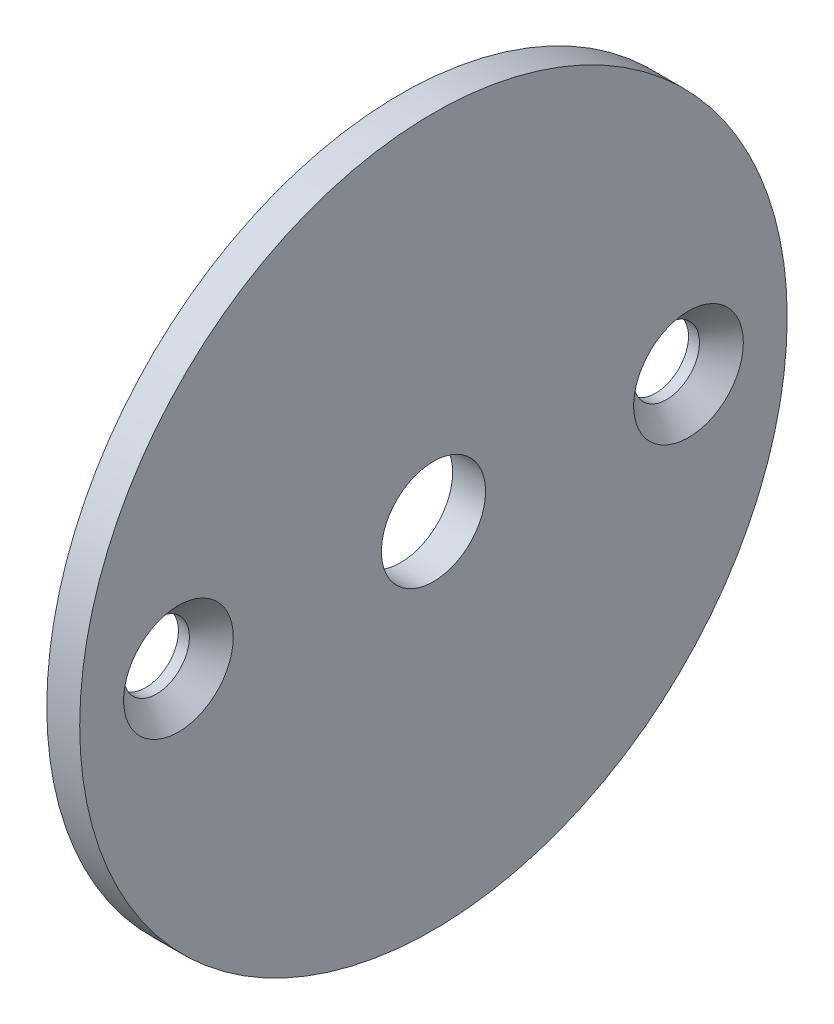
ISO-10303-21;
HEADER;
FILE_DESCRIPTION(('STEP AP214'),'2;1');
FILE_NAME('part.step','',(''),(''),'','','');
FILE_SCHEMA(('AUTOMOTIVE_DESIGN { 1 0 10303 214 1 1 1 1 }'));
ENDSEC;
DATA;
#1=APPLICATION_CONTEXT('core data for automotive mechanical design processes');
#2=APPLICATION_PROTOCOL_DEFINITION('international standard','automotive_design',2000,#1);
#3=PRODUCT_CONTEXT('',#1,'mechanical');
#4=PRODUCT('Part','Part','',(#3));
#5=PRODUCT_RELATED_PRODUCT_CATEGORY('part','',(#4));
#6=PRODUCT_DEFINITION_FORMATION('','',#4);
#7=PRODUCT_DEFINITION_CONTEXT('part definition',#1,'design');
#8=PRODUCT_DEFINITION('design','',#6,#7);
#9=PRODUCT_DEFINITION_SHAPE('','',#8);
#10=(LENGTH_UNIT() NAMED_UNIT(*) SI_UNIT(.MILLI.,.METRE.));
#11=(NAMED_UNIT(*) PLANE_ANGLE_UNIT() SI_UNIT($,.RADIAN.));
#12=(NAMED_UNIT(*) SI_UNIT($,.STERADIAN.) SOLID_ANGLE_UNIT());
#13=UNCERTAINTY_MEASURE_WITH_UNIT(LENGTH_MEASURE(1.E-05),#10,'distance_accuracy_value','');
#14=(GEOMETRIC_REPRESENTATION_CONTEXT(3) GLOBAL_UNCERTAINTY_ASSIGNED_CONTEXT((#13)) GLOBAL_UNIT_ASSIGNED_CONTEXT((#10,
#11,#12)) REPRESENTATION_CONTEXT('',''));
#15=CARTESIAN_POINT('',(0.,0.,0.));
#16=DIRECTION('',(0.,0.,1.));
#17=DIRECTION('',(1.,0.,0.));
#18=AXIS2_PLACEMENT_3D('',#15,#16,#17);
#19=CARTESIAN_POINT('',(-3.,0.,0.));
#20=DIRECTION('',(1.,0.,0.));
#21=DIRECTION('',(0.,0.,-1.));
#22=AXIS2_PLACEMENT_3D('',#19,#20,#21);
#23=CYLINDRICAL_SURFACE('',#22,32.25);
#24=CARTESIAN_POINT('',(-3.,0.,0.));
#25=DIRECTION('',(1.,0.,0.));
#26=DIRECTION('',(0.,0.,-1.));
#27=AXIS2_PLACEMENT_3D('',#24,#25,#26);
#28=CIRCLE('',#27,32.25);
#29=CARTESIAN_POINT('',(-3.,0.,-32.25));
#30=VERTEX_POINT('',#29);
#31=EDGE_CURVE('E55',#30,#30,#28,.T.);
#32=ORIENTED_EDGE('',*,*,#31,.T.);
#33=EDGE_LOOP('',(#32));
#34=FACE_BOUND('',#33,.T.);
#35=CARTESIAN_POINT('',(0.,0.,0.));
#36=DIRECTION('',(1.,0.,0.));
#37=DIRECTION('',(0.,0.,-1.));
#38=AXIS2_PLACEMENT_3D('',#35,#36,#37);
#39=CIRCLE('',#38,32.25);
#40=CARTESIAN_POINT('',(0.,0.,-32.25));
#41=VERTEX_POINT('',#40);
#42=EDGE_CURVE('E56',#41,#41,#39,.T.);
#43=ORIENTED_EDGE('',*,*,#42,.F.);
#44=EDGE_LOOP('',(#43));
#45=FACE_BOUND('',#44,.T.);
#46=ADVANCED_FACE('F35',(#34,#45),#23,.T.);
#47=CARTESIAN_POINT('',(-3.,0.,0.));
#48=DIRECTION('',(1.,0.,0.));
#49=DIRECTION('',(0.,0.,-1.));
#50=AXIS2_PLACEMENT_3D('',#47,#48,#49);
#51=PLANE('',#50);
#52=CARTESIAN_POINT('',(-3.,0.,23.25));
#53=DIRECTION('',(1.,0.,0.));
#54=DIRECTION('',(0.,0.,-1.));
#55=AXIS2_PLACEMENT_3D('',#52,#53,#54);
#56=CIRCLE('',#55,2.99999999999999);
#57=CARTESIAN_POINT('',(-3.,0.,20.25));
#58=VERTEX_POINT('',#57);
#59=EDGE_CURVE('E70',#58,#58,#56,.T.);
#60=ORIENTED_EDGE('',*,*,#59,.T.);
#61=EDGE_LOOP('',(#60));
#62=FACE_BOUND('',#61,.T.);
#63=CARTESIAN_POINT('',(-3.,0.,-23.25));
#64=DIRECTION('',(1.,0.,0.));
#65=DIRECTION('',(0.,0.,-1.));
#66=AXIS2_PLACEMENT_3D('',#63,#64,#65);
#67=CIRCLE('',#66,2.99999999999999);
#68=CARTESIAN_POINT('',(-3.,0.,-26.25));
#69=VERTEX_POINT('',#68);
#70=EDGE_CURVE('E65',#69,#69,#67,.T.);
#71=ORIENTED_EDGE('',*,*,#70,.T.);
#72=EDGE_LOOP('',(#71));
#73=FACE_BOUND('',#72,.T.);
#74=CARTESIAN_POINT('',(-3.,0.,0.));
#75=DIRECTION('',(1.,0.,0.));
#76=DIRECTION('',(0.,0.,-1.));
#77=AXIS2_PLACEMENT_3D('',#74,#75,#76);
#78=CIRCLE('',#77,4.75);
#79=CARTESIAN_POINT('',(-3.,0.,-4.75));
#80=VERTEX_POINT('',#79);
#81=EDGE_CURVE('E59',#80,#80,#78,.T.);
#82=ORIENTED_EDGE('',*,*,#81,.T.);
#83=EDGE_LOOP('',(#82));
#84=FACE_BOUND('',#83,.T.);
#85=ORIENTED_EDGE('',*,*,#31,.F.);
#86=EDGE_LOOP('',(#85));
#87=FACE_BOUND('',#86,.T.);
#88=ADVANCED_FACE('F74',(#62,#73,#84,#87),#51,.F.);
#89=CARTESIAN_POINT('',(0.,0.,0.));
#90=DIRECTION('',(1.,0.,0.));
#91=DIRECTION('',(0.,0.,-1.));
#92=AXIS2_PLACEMENT_3D('',#89,#90,#91);
#93=PLANE('',#92);
#94=CARTESIAN_POINT('',(0.,0.,-23.25));
#95=DIRECTION('',(1.,0.,0.));
#96=DIRECTION('',(0.,0.,-1.));
#97=AXIS2_PLACEMENT_3D('',#94,#95,#96);
#98=CIRCLE('',#97,5.);
#99=CARTESIAN_POINT('',(0.,0.,-28.25));
#100=VERTEX_POINT('',#99);
#101=EDGE_CURVE('E42',#100,#100,#98,.F.);
#102=ORIENTED_EDGE('',*,*,#101,.T.);
#103=EDGE_LOOP('',(#102));
#104=FACE_BOUND('',#103,.T.);
#105=CARTESIAN_POINT('',(0.,0.,23.25));
#106=DIRECTION('',(1.,0.,0.));
#107=DIRECTION('',(0.,0.,-1.));
#108=AXIS2_PLACEMENT_3D('',#105,#106,#107);
#109=CIRCLE('',#108,5.);
#110=CARTESIAN_POINT('',(0.,0.,18.25));
#111=VERTEX_POINT('',#110);
#112=EDGE_CURVE('E46',#111,#111,#109,.F.);
#113=ORIENTED_EDGE('',*,*,#112,.T.);
#114=EDGE_LOOP('',(#113));
#115=FACE_BOUND('',#114,.T.);
#116=CARTESIAN_POINT('',(0.,0.,0.));
#117=DIRECTION('',(1.,0.,0.));
#118=DIRECTION('',(0.,0.,-1.));
#119=AXIS2_PLACEMENT_3D('',#116,#117,#118);
#120=CIRCLE('',#119,4.75);
#121=CARTESIAN_POINT('',(0.,0.,-4.75));
#122=VERTEX_POINT('',#121);
#123=EDGE_CURVE('E62',#122,#122,#120,.T.);
#124=ORIENTED_EDGE('',*,*,#123,.F.);
#125=EDGE_LOOP('',(#124));
#126=FACE_BOUND('',#125,.T.);
#127=ORIENTED_EDGE('',*,*,#42,.T.);
#128=EDGE_LOOP('',(#127));
#129=FACE_BOUND('',#128,.T.);
#130=ADVANCED_FACE('F96',(#104,#115,#126,#129),#93,.T.);
#131=CARTESIAN_POINT('',(-3.,0.,0.));
#132=DIRECTION('',(1.,0.,0.));
#133=DIRECTION('',(0.,0.,-1.));
#134=AXIS2_PLACEMENT_3D('',#131,#132,#133);
#135=CYLINDRICAL_SURFACE('',#134,4.75);
#136=ORIENTED_EDGE('',*,*,#81,.F.);
#137=EDGE_LOOP('',(#136));
#138=FACE_BOUND('',#137,.T.);
#139=ORIENTED_EDGE('',*,*,#123,.T.);
#140=EDGE_LOOP('',(#139));
#141=FACE_BOUND('',#140,.T.);
#142=ADVANCED_FACE('F87',(#138,#141),#135,.F.);
#143=CARTESIAN_POINT('',(0.,0.,-23.25));
#144=DIRECTION('',(1.,0.,0.));
#145=DIRECTION('',(0.,0.,-1.));
#146=AXIS2_PLACEMENT_3D('',#143,#144,#145);
#147=CYLINDRICAL_SURFACE('',#146,2.99999999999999);
#148=CARTESIAN_POINT('',(-2.00000000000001,0.,-23.25));
#149=DIRECTION('',(1.,0.,0.));
#150=DIRECTION('',(0.,0.,-1.));
#151=AXIS2_PLACEMENT_3D('',#148,#149,#150);
#152=CIRCLE('',#151,2.99999999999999);
#153=CARTESIAN_POINT('',(-2.00000000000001,0.,-26.25));
#154=VERTEX_POINT('',#153);
#155=EDGE_CURVE('E50',#154,#154,#152,.T.);
#156=ORIENTED_EDGE('',*,*,#155,.T.);
#157=EDGE_LOOP('',(#156));
#158=FACE_BOUND('',#157,.T.);
#159=ORIENTED_EDGE('',*,*,#70,.F.);
#160=EDGE_LOOP('',(#159));
#161=FACE_BOUND('',#160,.T.);
#162=ADVANCED_FACE('F80',(#158,#161),#147,.F.);
#163=CARTESIAN_POINT('',(0.,0.,23.25));
#164=DIRECTION('',(1.,0.,0.));
#165=DIRECTION('',(0.,0.,-1.));
#166=AXIS2_PLACEMENT_3D('',#163,#164,#165);
#167=CYLINDRICAL_SURFACE('',#166,2.99999999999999);
#168=CARTESIAN_POINT('',(-2.00000000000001,0.,23.25));
#169=DIRECTION('',(1.,0.,0.));
#170=DIRECTION('',(0.,0.,-1.));
#171=AXIS2_PLACEMENT_3D('',#168,#169,#170);
#172=CIRCLE('',#171,2.99999999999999);
#173=CARTESIAN_POINT('',(-2.00000000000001,0.,20.25));
#174=VERTEX_POINT('',#173);
#175=EDGE_CURVE('E10',#174,#174,#172,.T.);
#176=ORIENTED_EDGE('',*,*,#175,.T.);
#177=EDGE_LOOP('',(#176));
#178=FACE_BOUND('',#177,.T.);
#179=ORIENTED_EDGE('',*,*,#59,.F.);
#180=EDGE_LOOP('',(#179));
#181=FACE_BOUND('',#180,.T.);
#182=ADVANCED_FACE('F77',(#178,#181),#167,.F.);
#183=CARTESIAN_POINT('',(-2.00000000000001,0.,-23.25));
#184=DIRECTION('',(1.,0.,0.));
#185=DIRECTION('',(0.,0.,-1.));
#186=AXIS2_PLACEMENT_3D('',#183,#184,#185);
#187=CONICAL_SURFACE('',#186,2.99999999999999,0.785398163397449);
#188=ORIENTED_EDGE('',*,*,#101,.F.);
#189=EDGE_LOOP('',(#188));
#190=FACE_BOUND('',#189,.T.);
#191=ORIENTED_EDGE('',*,*,#155,.F.);
#192=EDGE_LOOP('',(#191));
#193=FACE_BOUND('',#192,.T.);
#194=ADVANCED_FACE('F79',(#190,#193),#187,.F.);
#195=CARTESIAN_POINT('',(-2.00000000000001,0.,23.25));
#196=DIRECTION('',(1.,0.,0.));
#197=DIRECTION('',(0.,0.,-1.));
#198=AXIS2_PLACEMENT_3D('',#195,#196,#197);
#199=CONICAL_SURFACE('',#198,2.99999999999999,0.785398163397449);
#200=ORIENTED_EDGE('',*,*,#112,.F.);
#201=EDGE_LOOP('',(#200));
#202=FACE_BOUND('',#201,.T.);
#203=ORIENTED_EDGE('',*,*,#175,.F.);
#204=EDGE_LOOP('',(#203));
#205=FACE_BOUND('',#204,.T.);
#206=ADVANCED_FACE('F37',(#202,#205),#199,.F.);
#207=CLOSED_SHELL('',(#46,#88,#130,#142,#162,#182,#194,#206));
#208=MANIFOLD_SOLID_BREP('B2',#207);
#209=ADVANCED_BREP_SHAPE_REPRESENTATION('',(#18,#208),#14);
#210=SHAPE_DEFINITION_REPRESENTATION(#9,#209);
ENDSEC;
END-ISO-10303-21;
